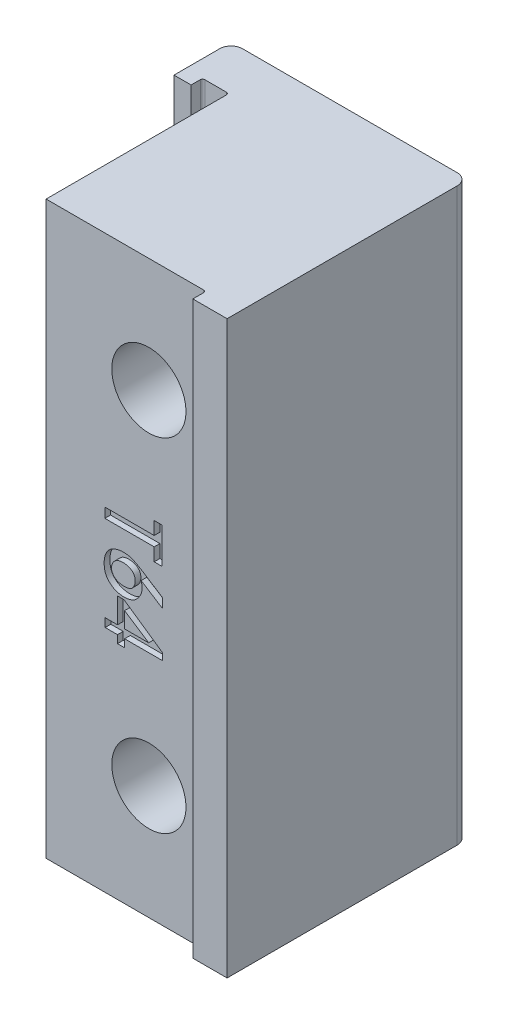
from build123d import *

# Parameters (mm, degrees)
EXTRUDE_1_DEPTH           = 50
HOLE_WIZARD_0_D           = 6.5
HOLE_WIZARD_0_CBORE_D     = 11
HOLE_WIZARD_0_CBORE_DEPTH = 6.5
FILLET_1_R                = 0.2
FILLET_2_R                = 0.2
FILLET_3_R                = 0.2
FILLET_4_R                = 1
FILLET_5_R                = 1
CUT_EXTRUDE_2_DEPTH       = 0.5


with BuildPart() as part:
    # Sketch 1 → Extrude 1 (new body)
    with BuildSketch(Plane(origin=(0, 0, 0), x_dir=(1, 0, 0), z_dir=(0, 1, 0))):
        Polygon((-20.8, -5), (-19.3, -5), (-19.3, -4), (-17, -4), (-17, -20), (-3, -20), (-3, -21.15), (0, -21.15), (0, 0), (-20.8, 0), align=None)
    extrude(amount=EXTRUDE_1_DEPTH)

    # Hole Wizard 0 (through all)
    with Locations(Plane(origin=(0, 0, 0), x_dir=(-1, 0, 0), z_dir=(0, 0, -1))):
        with Locations((8, 40), (8, 10)):
            CounterBoreHole(HOLE_WIZARD_0_D / 2, HOLE_WIZARD_0_CBORE_D / 2, HOLE_WIZARD_0_CBORE_DEPTH)

    # Fillet 1
    fillet_1_edges = [part.edges().sort_by_distance(p)[0] for p in [
        (-19.3, 25, 4),
    ]]
    fillet(fillet_1_edges, radius=FILLET_1_R)

    # Fillet 2
    fillet_2_edges = [part.edges().sort_by_distance(p)[0] for p in [
        (-17, 25, 4),
    ]]
    fillet(fillet_2_edges, radius=FILLET_2_R)

    # Fillet 3
    fillet_3_edges = [part.edges().sort_by_distance(p)[0] for p in [
        (-3, 25, 20),
    ]]
    fillet(fillet_3_edges, radius=FILLET_3_R)

    # Fillet 4
    fillet_4_edges = [part.edges().sort_by_distance(p)[0] for p in [
        (0, 25, 0),
    ]]
    fillet(fillet_4_edges, radius=FILLET_4_R)

    # Fillet 5
    fillet_5_edges = [part.edges().sort_by_distance(p)[0] for p in [
        (-20.8, 25, 0),
    ]]
    fillet(fillet_5_edges, radius=FILLET_5_R)

    # Sketch 5 → Cut-Extrude 2 (cut)
    # profile 1 of 3: a face of its own
    with BuildSketch(Plane.XY.offset(20)):
        Polygon((-7.534449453, 27.218287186), (-7.534449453, 28.355870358), (-11.857265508, 28.355870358), (-11.857265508, 29.215496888), (-7.534449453, 29.215496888), (-7.534449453, 30.35308006), (-6.857265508, 30.35308006), (-6.857265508, 27.218287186), align=None)
    # profile 2 of 3: a face of its own
    with BuildSketch(Plane.XY.offset(20)):
        with BuildLine():
            add(Edge.make_bspline(
                [(-10.092938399, 26.603348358), (-10.024486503, 26.597613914), (-9.892302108, 26.586540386), (-9.703743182, 26.553438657), (-9.532109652, 26.507731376), (-9.373432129, 26.445818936), (-9.214977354, 26.36881618), (-9.043515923, 26.278372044), (-8.853542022, 26.172016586), (-8.721934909, 26.093891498), (-8.652715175, 26.05280103)],
                knots=[0, 0, 0, 0, 1.055727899, 2.038668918, 2.939312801, 3.782014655, 4.652945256, 5.646889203, 6.762363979, 8, 8, 8, 8], degree=3))
            Line((-8.652715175, 26.05280103), (-6.800386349, 24.866924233))
            Line((-6.800386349, 24.866924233), (-6.800386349, 24.03734707))
            Line((-6.800386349, 24.03734707), (-8.677398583, 25.231809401))
            add(Edge.make_bspline(
                [(-8.677398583, 25.231809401), (-8.662012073, 25.177684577), (-8.632028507, 25.072211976), (-8.606077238, 24.913489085), (-8.592198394, 24.760256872), (-8.594321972, 24.611724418), (-8.611173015, 24.468071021), (-8.644188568, 24.329836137), (-8.689496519, 24.195576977), (-8.752972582, 24.06974361), (-8.822016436, 23.95100656), (-8.893806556, 23.841194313), (-8.967773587, 23.742046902), (-9.044382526, 23.65367182), (-9.122031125, 23.575210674), (-9.202507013, 23.507686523), (-9.28471691, 23.450721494), (-9.396982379, 23.389522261), (-9.542331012, 23.330293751), (-9.722386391, 23.277926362), (-9.907677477, 23.241696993), (-10.097635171, 23.226304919), (-10.289864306, 23.228295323), (-10.482032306, 23.248961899), (-10.673094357, 23.286894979), (-10.862884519, 23.341682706), (-11.048826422, 23.421502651), (-11.228870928, 23.528938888), (-11.40053776, 23.666302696), (-11.537370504, 23.799380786), (-11.637994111, 23.921303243), (-11.705237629, 24.023474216), (-11.762635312, 24.134175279), (-11.812773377, 24.253036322), (-11.852139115, 24.381102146), (-11.881608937, 24.517633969), (-11.903536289, 24.662404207), (-11.914361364, 24.813435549), (-11.917675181, 24.965674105), (-11.912824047, 25.114474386), (-11.897592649, 25.257124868), (-11.874353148, 25.393459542), (-11.841928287, 25.523298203), (-11.800962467, 25.647006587), (-11.752366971, 25.765361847), (-11.692433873, 25.875939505), (-11.626524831, 25.979956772), (-11.553198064, 26.075440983), (-11.474709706, 26.163506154), (-11.388484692, 26.241902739), (-11.295484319, 26.311769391), (-11.196986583, 26.374635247), (-11.090754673, 26.426953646), (-10.943537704, 26.486106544), (-10.755349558, 26.541032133), (-10.531322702, 26.588899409), (-10.310091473, 26.610030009), (-10.164860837, 26.605561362), (-10.092938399, 26.603348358)],
                knots=[0, 0, 0, 0, 1.108409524, 2.159948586, 3.16491185, 4.138199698, 5.082887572, 6.010013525, 6.935555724, 7.869123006, 8.782332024, 9.642944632, 10.453932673, 11.218846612, 11.946885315, 12.627693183, 13.286901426, 13.915010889, 15.144783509, 16.372127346, 17.607206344, 18.859896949, 20.122296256, 21.391708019, 22.664093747, 23.958297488, 25.278749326, 26.64177051, 28.077970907, 29.603892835, 30.395799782, 31.189901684, 32.010036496, 32.850860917, 33.729685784, 34.646807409, 35.602252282, 36.613677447, 37.629395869, 38.603220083, 39.546327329, 40.455278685, 41.32757156, 42.181687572, 43.022511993, 43.845944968, 44.657791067, 45.44765438, 46.216621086, 46.98036384, 47.74058221, 48.507541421, 49.280217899, 50.071182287, 51.632861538, 53.137615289, 54.582463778, 56, 56, 56, 56], degree=3))
        make_face()
        with BuildLine():
            add(Edge.make_bspline(
                [(-10.999785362, 25.545181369), (-11.019511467, 25.525522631), (-11.058364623, 25.486802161), (-11.109375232, 25.422359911), (-11.153516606, 25.353831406), (-11.189960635, 25.280184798), (-11.220128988, 25.202606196), (-11.243820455, 25.120363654), (-11.260902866, 25.033860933), (-11.270536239, 24.944104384), (-11.272024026, 24.854184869), (-11.263153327, 24.766050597), (-11.245658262, 24.681002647), (-11.215259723, 24.599936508), (-11.178562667, 24.520914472), (-11.128880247, 24.446189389), (-11.07007125, 24.374839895), (-11.002202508, 24.306785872), (-10.925323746, 24.244526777), (-10.838726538, 24.190728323), (-10.743665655, 24.145484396), (-10.640169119, 24.109487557), (-10.528587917, 24.080400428), (-10.408819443, 24.058708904), (-10.279891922, 24.047896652), (-10.145877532, 24.043177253), (-10.012770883, 24.048297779), (-9.887282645, 24.062664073), (-9.772729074, 24.088188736), (-9.669245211, 24.124481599), (-9.576796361, 24.170937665), (-9.495114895, 24.227167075), (-9.424142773, 24.294051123), (-9.367387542, 24.372427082), (-9.318270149, 24.454562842), (-9.277348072, 24.539384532), (-9.245183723, 24.626069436), (-9.219651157, 24.713769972), (-9.205751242, 24.803943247), (-9.195873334, 24.894956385), (-9.198040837, 24.98804369), (-9.206080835, 25.081406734), (-9.222516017, 25.173050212), (-9.249662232, 25.259363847), (-9.285272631, 25.339893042), (-9.330175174, 25.414024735), (-9.385323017, 25.481553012), (-9.448075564, 25.543849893), (-9.521408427, 25.599003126), (-9.629627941, 25.663668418), (-9.775437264, 25.72975302), (-9.960581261, 25.782748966), (-10.153622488, 25.808668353), (-10.317603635, 25.806793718), (-10.448253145, 25.794389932), (-10.542330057, 25.77861745), (-10.631321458, 25.755858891), (-10.715300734, 25.726775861), (-10.794699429, 25.691916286), (-10.868310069, 25.649168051), (-10.937542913, 25.601388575), (-10.979059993, 25.563897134), (-10.999785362, 25.545181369)],
                knots=[0, 0, 0, 0, 0.816608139, 1.608417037, 2.406256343, 3.204302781, 4.015223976, 4.845746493, 5.712430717, 6.599223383, 7.491528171, 8.345920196, 9.194164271, 10.030899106, 10.880700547, 11.745411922, 12.655324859, 13.590557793, 14.561059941, 15.551342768, 16.574892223, 17.643936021, 18.761654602, 19.95591353, 21.210379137, 22.55464809, 23.888796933, 25.115282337, 26.256125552, 27.32516935, 28.325085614, 29.283074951, 30.225993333, 31.170721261, 32.112236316, 33.032444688, 33.929306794, 34.823277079, 35.706833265, 36.603019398, 37.505820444, 38.433363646, 39.351594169, 40.231401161, 41.081915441, 41.929834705, 42.765910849, 43.63437315, 44.518241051, 45.450760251, 47.329836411, 49.197059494, 51.082428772, 53.024397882, 53.994729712, 54.931787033, 55.820317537, 56.686747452, 57.537261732, 58.360120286, 59.181370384, 60, 60, 60, 60], degree=3))
        make_face(mode=Mode.SUBTRACT)
    # profile 3 of 3: a face of its own
    with BuildSketch(Plane.XY.offset(20)):
        Polygon((-10.74865851, 20.836016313), (-10.74865851, 23.025327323), (-10.174500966, 23.025327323), (-6.800386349, 20.690062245), (-6.800386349, 20.089074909), (-10.127280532, 20.089074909), (-10.127280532, 19.406525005), (-10.74865851, 19.406525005), (-10.74865851, 20.089074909), (-11.829362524, 20.089074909), (-11.829362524, 20.836016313), align=None)
        Polygon((-10.127280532, 20.836016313), (-8.018458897, 20.836016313), (-10.127280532, 22.222579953), align=None, mode=Mode.SUBTRACT)
    extrude(amount=-CUT_EXTRUDE_2_DEPTH, mode=Mode.SUBTRACT)


solid = part.part
